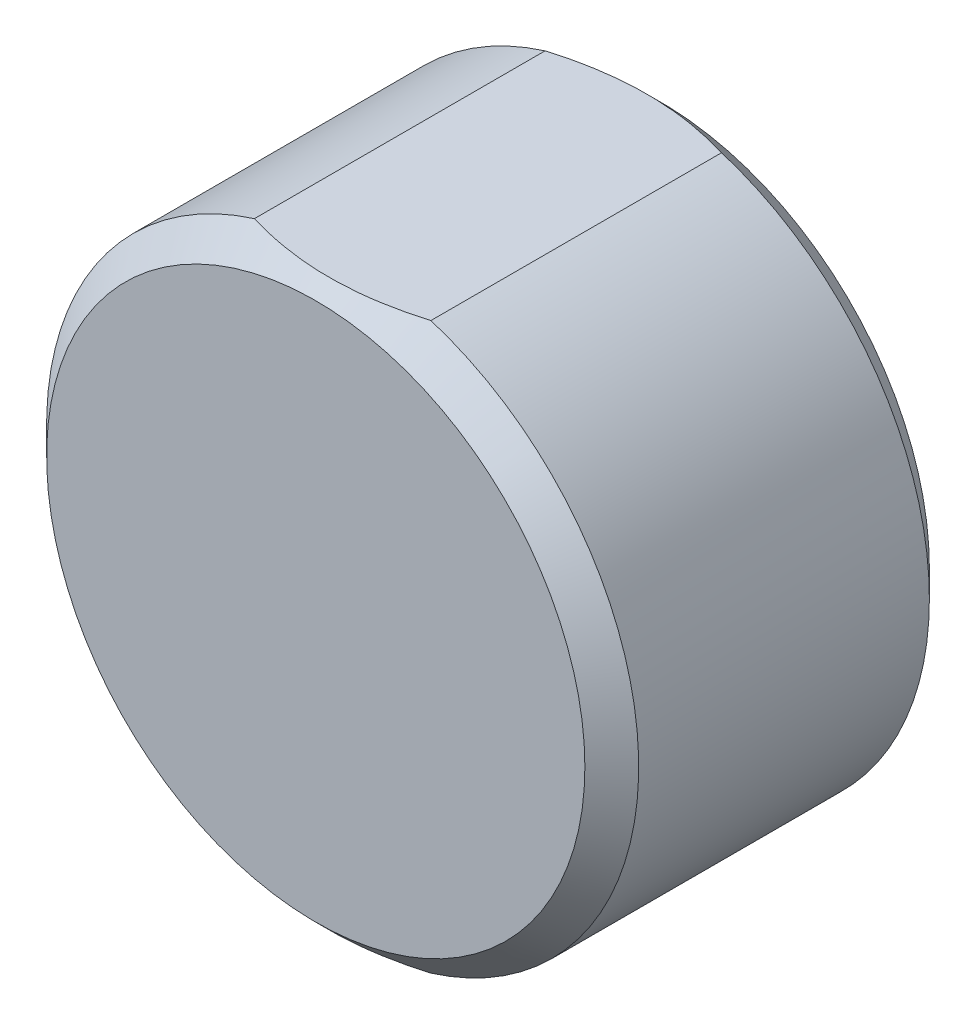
ISO-10303-21;
HEADER;
FILE_DESCRIPTION(('STEP AP214'),'2;1');
FILE_NAME('part.step','',(''),(''),'','','');
FILE_SCHEMA(('AUTOMOTIVE_DESIGN { 1 0 10303 214 1 1 1 1 }'));
ENDSEC;
DATA;
#1=APPLICATION_CONTEXT('core data for automotive mechanical design processes');
#2=APPLICATION_PROTOCOL_DEFINITION('international standard','automotive_design',2000,#1);
#3=PRODUCT_CONTEXT('',#1,'mechanical');
#4=PRODUCT('Part','Part','',(#3));
#5=PRODUCT_RELATED_PRODUCT_CATEGORY('part','',(#4));
#6=PRODUCT_DEFINITION_FORMATION('','',#4);
#7=PRODUCT_DEFINITION_CONTEXT('part definition',#1,'design');
#8=PRODUCT_DEFINITION('design','',#6,#7);
#9=PRODUCT_DEFINITION_SHAPE('','',#8);
#10=(LENGTH_UNIT() NAMED_UNIT(*) SI_UNIT(.MILLI.,.METRE.));
#11=(NAMED_UNIT(*) PLANE_ANGLE_UNIT() SI_UNIT($,.RADIAN.));
#12=(NAMED_UNIT(*) SI_UNIT($,.STERADIAN.) SOLID_ANGLE_UNIT());
#13=UNCERTAINTY_MEASURE_WITH_UNIT(LENGTH_MEASURE(1.E-05),#10,'distance_accuracy_value','');
#14=(GEOMETRIC_REPRESENTATION_CONTEXT(3) GLOBAL_UNCERTAINTY_ASSIGNED_CONTEXT((#13)) GLOBAL_UNIT_ASSIGNED_CONTEXT((#10,
#11,#12)) REPRESENTATION_CONTEXT('',''));
#15=CARTESIAN_POINT('',(0.,0.,0.));
#16=DIRECTION('',(0.,0.,1.));
#17=DIRECTION('',(1.,0.,0.));
#18=AXIS2_PLACEMENT_3D('',#15,#16,#17);
#19=CARTESIAN_POINT('',(0.,0.,12.8));
#20=DIRECTION('',(0.,0.,-1.));
#21=DIRECTION('',(-1.,0.,0.));
#22=AXIS2_PLACEMENT_3D('',#19,#20,#21);
#23=CYLINDRICAL_SURFACE('',#22,11.);
#24=DIRECTION('',(0.,0.,1.));
#25=VECTOR('',#24,1.);
#26=CARTESIAN_POINT('',(-3.278719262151,-10.5,0.));
#27=LINE('',#26,#25);
#28=CARTESIAN_POINT('',(-3.278719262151,-10.5,1.));
#29=VERTEX_POINT('',#28);
#30=CARTESIAN_POINT('',(-3.278719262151,-10.5,11.8));
#31=VERTEX_POINT('',#30);
#32=EDGE_CURVE('E85',#29,#31,#27,.T.);
#33=ORIENTED_EDGE('',*,*,#32,.T.);
#34=CARTESIAN_POINT('',(0.,0.,11.8));
#35=DIRECTION('',(0.,0.,1.));
#36=DIRECTION('',(1.,0.,0.));
#37=AXIS2_PLACEMENT_3D('',#34,#35,#36);
#38=CIRCLE('',#37,11.);
#39=CARTESIAN_POINT('',(-3.278719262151,10.5,11.8));
#40=VERTEX_POINT('',#39);
#41=EDGE_CURVE('E65',#31,#40,#38,.F.);
#42=ORIENTED_EDGE('',*,*,#41,.T.);
#43=DIRECTION('',(0.,0.,1.));
#44=VECTOR('',#43,1.);
#45=CARTESIAN_POINT('',(-3.278719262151,10.5,0.));
#46=LINE('',#45,#44);
#47=CARTESIAN_POINT('',(-3.278719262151,10.5,1.));
#48=VERTEX_POINT('',#47);
#49=EDGE_CURVE('E90',#48,#40,#46,.T.);
#50=ORIENTED_EDGE('',*,*,#49,.F.);
#51=CARTESIAN_POINT('',(0.,0.,1.));
#52=DIRECTION('',(0.,0.,1.));
#53=DIRECTION('',(1.,0.,0.));
#54=AXIS2_PLACEMENT_3D('',#51,#52,#53);
#55=CIRCLE('',#54,11.);
#56=EDGE_CURVE('E104',#48,#29,#55,.T.);
#57=ORIENTED_EDGE('',*,*,#56,.T.);
#58=EDGE_LOOP('',(#33,#42,#50,#57));
#59=FACE_BOUND('',#58,.T.);
#60=ADVANCED_FACE('F38',(#59),#23,.T.);
#61=DIRECTION('',(0.,0.,1.));
#62=VECTOR('',#61,1.);
#63=CARTESIAN_POINT('',(3.278719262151,-10.5,0.));
#64=LINE('',#63,#62);
#65=CARTESIAN_POINT('',(3.278719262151,-10.5,1.));
#66=VERTEX_POINT('',#65);
#67=CARTESIAN_POINT('',(3.278719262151,-10.5,11.8));
#68=VERTEX_POINT('',#67);
#69=EDGE_CURVE('E58',#66,#68,#64,.T.);
#70=ORIENTED_EDGE('',*,*,#69,.F.);
#71=CARTESIAN_POINT('',(3.278719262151,10.5,1.));
#72=VERTEX_POINT('',#71);
#73=EDGE_CURVE('E96',#66,#72,#55,.T.);
#74=ORIENTED_EDGE('',*,*,#73,.T.);
#75=DIRECTION('',(0.,0.,1.));
#76=VECTOR('',#75,1.);
#77=CARTESIAN_POINT('',(3.278719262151,10.5,0.));
#78=LINE('',#77,#76);
#79=CARTESIAN_POINT('',(3.278719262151,10.5,11.8));
#80=VERTEX_POINT('',#79);
#81=EDGE_CURVE('E132',#72,#80,#78,.T.);
#82=ORIENTED_EDGE('',*,*,#81,.T.);
#83=EDGE_CURVE('E99',#80,#68,#38,.F.);
#84=ORIENTED_EDGE('',*,*,#83,.T.);
#85=EDGE_LOOP('',(#70,#74,#82,#84));
#86=FACE_BOUND('',#85,.T.);
#87=ADVANCED_FACE('F94',(#86),#23,.T.);
#88=CARTESIAN_POINT('',(0.,0.,1.));
#89=DIRECTION('',(0.,0.,1.));
#90=DIRECTION('',(1.,0.,0.));
#91=AXIS2_PLACEMENT_3D('',#88,#89,#90);
#92=CONICAL_SURFACE('',#91,11.,0.785398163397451);
#93=CARTESIAN_POINT('',(0.,0.,0.));
#94=DIRECTION('',(0.,0.,1.));
#95=DIRECTION('',(1.,0.,0.));
#96=AXIS2_PLACEMENT_3D('',#93,#94,#95);
#97=CIRCLE('',#96,9.99999999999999);
#98=CARTESIAN_POINT('',(9.99999999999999,0.,0.));
#99=VERTEX_POINT('',#98);
#100=EDGE_CURVE('E106',#99,#99,#97,.F.);
#101=ORIENTED_EDGE('',*,*,#100,.F.);
#102=EDGE_LOOP('',(#101));
#103=FACE_BOUND('',#102,.T.);
#104=ORIENTED_EDGE('',*,*,#73,.F.);
#105=CARTESIAN_POINT('',(-7.10787288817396,-10.5,2.67958425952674));
#106=CARTESIAN_POINT('',(-6.92421202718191,-10.5,2.57664145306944));
#107=CARTESIAN_POINT('',(-6.73938207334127,-10.5,2.47575406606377));
#108=CARTESIAN_POINT('',(-6.36717527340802,-10.5,2.27867675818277));
#109=CARTESIAN_POINT('',(-6.17979777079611,-10.5,2.18248807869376));
#110=CARTESIAN_POINT('',(-5.80165719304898,-10.5,1.99508960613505));
#111=CARTESIAN_POINT('',(-5.6108838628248,-10.5,1.90390040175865));
#112=CARTESIAN_POINT('',(-5.22655261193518,-10.5,1.72764693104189));
#113=CARTESIAN_POINT('',(-5.0329948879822,-10.5,1.64258223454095));
#114=CARTESIAN_POINT('',(-4.44277596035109,-10.5,1.39558317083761));
#115=CARTESIAN_POINT('',(-4.04152891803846,-10.5,1.24434861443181));
#116=CARTESIAN_POINT('',(-3.22760867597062,-10.5,0.978170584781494));
#117=CARTESIAN_POINT('',(-2.81495492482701,-10.5,0.863169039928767));
#118=CARTESIAN_POINT('',(-2.13622111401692,-10.5,0.712072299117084));
#119=CARTESIAN_POINT('',(-1.87311056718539,-10.5,0.662555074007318));
#120=CARTESIAN_POINT('',(-1.34396544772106,-10.5,0.582434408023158));
#121=CARTESIAN_POINT('',(-1.0779307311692,-10.5,0.551831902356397));
#122=CARTESIAN_POINT('',(-0.546362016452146,-10.5,0.510891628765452));
#123=CARTESIAN_POINT('',(-0.280840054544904,-10.5,0.500398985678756));
#124=CARTESIAN_POINT('',(0.250234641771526,-10.5,0.499623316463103));
#125=CARTESIAN_POINT('',(0.515787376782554,-10.5,0.509340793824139));
#126=CARTESIAN_POINT('',(1.08395998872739,-10.5,0.551469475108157));
#127=CARTESIAN_POINT('',(1.38635191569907,-10.5,0.58697659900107));
#128=CARTESIAN_POINT('',(1.98727779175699,-10.5,0.682282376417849));
#129=CARTESIAN_POINT('',(2.28581097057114,-10.5,0.742085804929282));
#130=CARTESIAN_POINT('',(2.88119857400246,-10.5,0.884240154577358));
#131=CARTESIAN_POINT('',(3.17798965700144,-10.5,0.966853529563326));
#132=CARTESIAN_POINT('',(3.76540687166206,-10.5,1.15125568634));
#133=CARTESIAN_POINT('',(4.05603435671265,-10.5,1.2530402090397));
#134=CARTESIAN_POINT('',(4.73983064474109,-10.5,1.51441626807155));
#135=CARTESIAN_POINT('',(5.13019879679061,-10.5,1.68130971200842));
#136=CARTESIAN_POINT('',(5.89983249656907,-10.5,2.03917911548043));
#137=CARTESIAN_POINT('',(6.2790914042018,-10.5,2.23016912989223));
#138=CARTESIAN_POINT('',(7.02893667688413,-10.5,2.63152047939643));
#139=CARTESIAN_POINT('',(7.39948593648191,-10.5,2.84195059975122));
#140=CARTESIAN_POINT('',(8.13175833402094,-10.5,3.27738225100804));
#141=CARTESIAN_POINT('',(8.49348324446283,-10.5,3.50238082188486));
#142=CARTESIAN_POINT('',(9.19181586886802,-10.5,3.95248427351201));
#143=CARTESIAN_POINT('',(9.52878209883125,-10.5,4.17703580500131));
#144=CARTESIAN_POINT('',(10.1969936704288,-10.5,4.63452836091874));
#145=CARTESIAN_POINT('',(10.5282385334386,-10.5,4.8674700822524));
#146=CARTESIAN_POINT('',(11.1829043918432,-10.5,5.33805465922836));
#147=CARTESIAN_POINT('',(11.5063687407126,-10.5,5.57563741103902));
#148=CARTESIAN_POINT('',(12.1490588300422,-10.5,6.05629666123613));
#149=CARTESIAN_POINT('',(12.4682856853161,-10.5,6.2993716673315));
#150=CARTESIAN_POINT('',(12.7857700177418,-10.5,6.54466424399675));
#151=B_SPLINE_CURVE_WITH_KNOTS('',3,(#105,#106,#107,#108,#109,#110,#111,#112,#113,#114,#115,
#116,#117,#118,#119,#120,#121,#122,#123,#124,#125,#126,#127,#128,#129,#130,#131,#132,#133,#134,
#135,#136,#137,#138,#139,#140,#141,#142,#143,#144,#145,#146,#147,#148,#149,#150),.UNSPECIFIED.,
.F.,.F.,(4,2,2,2,2,2,2,2,2,2,2,2,2,2,2,2,2,2,2,2,2,2,4),(0.,0.631638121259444,1.26344222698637,
1.8976781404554,2.53186946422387,3.8168873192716,5.09983504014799,5.90242490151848,
6.70505444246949,7.50147733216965,8.29792006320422,9.21023335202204,10.1227260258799,
11.0461900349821,11.9694491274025,13.2419777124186,14.5152519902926,15.7932179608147,
17.0709250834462,18.2855695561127,19.5003151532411,20.7042752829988,21.9079121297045),.UNSPECIFIED.);
#152=EDGE_CURVE('E83',#66,#29,#151,.F.);
#153=ORIENTED_EDGE('',*,*,#152,.T.);
#154=ORIENTED_EDGE('',*,*,#56,.F.);
#155=CARTESIAN_POINT('',(-7.10787288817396,10.5,2.67958425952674));
#156=CARTESIAN_POINT('',(-6.92421202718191,10.5,2.57664145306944));
#157=CARTESIAN_POINT('',(-6.73938207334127,10.5,2.47575406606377));
#158=CARTESIAN_POINT('',(-6.36717527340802,10.5,2.27867675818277));
#159=CARTESIAN_POINT('',(-6.17979777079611,10.5,2.18248807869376));
#160=CARTESIAN_POINT('',(-5.80165719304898,10.5,1.99508960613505));
#161=CARTESIAN_POINT('',(-5.6108838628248,10.5,1.90390040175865));
#162=CARTESIAN_POINT('',(-5.22655261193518,10.5,1.72764693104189));
#163=CARTESIAN_POINT('',(-5.0329948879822,10.5,1.64258223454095));
#164=CARTESIAN_POINT('',(-4.44277596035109,10.5,1.39558317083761));
#165=CARTESIAN_POINT('',(-4.04152891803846,10.5,1.24434861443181));
#166=CARTESIAN_POINT('',(-3.22760867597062,10.5,0.978170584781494));
#167=CARTESIAN_POINT('',(-2.81495492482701,10.5,0.863169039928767));
#168=CARTESIAN_POINT('',(-2.13622111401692,10.5,0.712072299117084));
#169=CARTESIAN_POINT('',(-1.87311056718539,10.5,0.662555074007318));
#170=CARTESIAN_POINT('',(-1.34396544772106,10.5,0.582434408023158));
#171=CARTESIAN_POINT('',(-1.0779307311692,10.5,0.551831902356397));
#172=CARTESIAN_POINT('',(-0.546362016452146,10.5,0.510891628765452));
#173=CARTESIAN_POINT('',(-0.280840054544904,10.5,0.500398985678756));
#174=CARTESIAN_POINT('',(0.250234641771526,10.5,0.499623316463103));
#175=CARTESIAN_POINT('',(0.515787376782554,10.5,0.509340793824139));
#176=CARTESIAN_POINT('',(1.08395998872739,10.5,0.551469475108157));
#177=CARTESIAN_POINT('',(1.38635191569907,10.5,0.58697659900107));
#178=CARTESIAN_POINT('',(1.98727779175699,10.5,0.682282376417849));
#179=CARTESIAN_POINT('',(2.28581097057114,10.5,0.742085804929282));
#180=CARTESIAN_POINT('',(2.88119857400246,10.5,0.884240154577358));
#181=CARTESIAN_POINT('',(3.17798965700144,10.5,0.966853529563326));
#182=CARTESIAN_POINT('',(3.76540687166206,10.5,1.15125568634));
#183=CARTESIAN_POINT('',(4.05603435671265,10.5,1.2530402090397));
#184=CARTESIAN_POINT('',(4.73983064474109,10.5,1.51441626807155));
#185=CARTESIAN_POINT('',(5.13019879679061,10.5,1.68130971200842));
#186=CARTESIAN_POINT('',(5.89983249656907,10.5,2.03917911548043));
#187=CARTESIAN_POINT('',(6.2790914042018,10.5,2.23016912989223));
#188=CARTESIAN_POINT('',(7.02893667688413,10.5,2.63152047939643));
#189=CARTESIAN_POINT('',(7.39948593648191,10.5,2.84195059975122));
#190=CARTESIAN_POINT('',(8.13175833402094,10.5,3.27738225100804));
#191=CARTESIAN_POINT('',(8.49348324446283,10.5,3.50238082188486));
#192=CARTESIAN_POINT('',(9.19181586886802,10.5,3.95248427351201));
#193=CARTESIAN_POINT('',(9.52878209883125,10.5,4.17703580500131));
#194=CARTESIAN_POINT('',(10.1969936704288,10.5,4.63452836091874));
#195=CARTESIAN_POINT('',(10.5282385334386,10.5,4.8674700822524));
#196=CARTESIAN_POINT('',(11.1829043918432,10.5,5.33805465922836));
#197=CARTESIAN_POINT('',(11.5063687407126,10.5,5.57563741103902));
#198=CARTESIAN_POINT('',(12.1490588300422,10.5,6.05629666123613));
#199=CARTESIAN_POINT('',(12.4682856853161,10.5,6.2993716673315));
#200=CARTESIAN_POINT('',(12.7857700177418,10.5,6.54466424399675));
#201=B_SPLINE_CURVE_WITH_KNOTS('',3,(#155,#156,#157,#158,#159,#160,#161,#162,#163,#164,#165,
#166,#167,#168,#169,#170,#171,#172,#173,#174,#175,#176,#177,#178,#179,#180,#181,#182,#183,#184,
#185,#186,#187,#188,#189,#190,#191,#192,#193,#194,#195,#196,#197,#198,#199,#200),.UNSPECIFIED.,
.F.,.F.,(4,2,2,2,2,2,2,2,2,2,2,2,2,2,2,2,2,2,2,2,2,2,4),(0.,0.631638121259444,1.26344222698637,
1.8976781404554,2.53186946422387,3.8168873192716,5.09983504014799,5.90242490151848,
6.70505444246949,7.50147733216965,8.29792006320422,9.21023335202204,10.1227260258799,
11.0461900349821,11.9694491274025,13.2419777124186,14.5152519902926,15.7932179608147,
17.0709250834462,18.2855695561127,19.5003151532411,20.7042752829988,21.9079121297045),.UNSPECIFIED.);
#202=EDGE_CURVE('E103',#72,#48,#201,.F.);
#203=ORIENTED_EDGE('',*,*,#202,.F.);
#204=EDGE_LOOP('',(#104,#153,#154,#203));
#205=FACE_BOUND('',#204,.T.);
#206=ADVANCED_FACE('F102',(#103,#205),#92,.T.);
#207=CARTESIAN_POINT('',(0.,0.,12.8));
#208=DIRECTION('',(0.,0.,-1.));
#209=DIRECTION('',(-1.,0.,0.));
#210=AXIS2_PLACEMENT_3D('',#207,#208,#209);
#211=CONICAL_SURFACE('',#210,10.,0.785398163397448);
#212=CARTESIAN_POINT('',(0.,0.,12.8));
#213=DIRECTION('',(0.,0.,1.));
#214=DIRECTION('',(1.,0.,0.));
#215=AXIS2_PLACEMENT_3D('',#212,#213,#214);
#216=CIRCLE('',#215,10.);
#217=CARTESIAN_POINT('',(10.,0.,12.8));
#218=VERTEX_POINT('',#217);
#219=EDGE_CURVE('E112',#218,#218,#216,.T.);
#220=ORIENTED_EDGE('',*,*,#219,.F.);
#221=EDGE_LOOP('',(#220));
#222=FACE_BOUND('',#221,.T.);
#223=ORIENTED_EDGE('',*,*,#41,.F.);
#224=CARTESIAN_POINT('',(-7.10787288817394,-10.5,10.1204157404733));
#225=CARTESIAN_POINT('',(-6.9242120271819,-10.5,10.2233585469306));
#226=CARTESIAN_POINT('',(-6.73938207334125,-10.5,10.3242459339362));
#227=CARTESIAN_POINT('',(-6.36717527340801,-10.5,10.5213232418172));
#228=CARTESIAN_POINT('',(-6.1797977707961,-10.5,10.6175119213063));
#229=CARTESIAN_POINT('',(-5.80165719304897,-10.5,10.804910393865));
#230=CARTESIAN_POINT('',(-5.61088386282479,-10.5,10.8960995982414));
#231=CARTESIAN_POINT('',(-5.22655261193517,-10.5,11.0723530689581));
#232=CARTESIAN_POINT('',(-5.03299488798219,-10.5,11.1574177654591));
#233=CARTESIAN_POINT('',(-4.44277596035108,-10.5,11.4044168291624));
#234=CARTESIAN_POINT('',(-4.04152891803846,-10.5,11.5556513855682));
#235=CARTESIAN_POINT('',(-3.22760867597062,-10.5,11.8218294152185));
#236=CARTESIAN_POINT('',(-2.81495492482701,-10.5,11.9368309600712));
#237=CARTESIAN_POINT('',(-2.13622111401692,-10.5,12.0879277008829));
#238=CARTESIAN_POINT('',(-1.8731105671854,-10.5,12.1374449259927));
#239=CARTESIAN_POINT('',(-1.34396544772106,-10.5,12.2175655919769));
#240=CARTESIAN_POINT('',(-1.0779307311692,-10.5,12.2481680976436));
#241=CARTESIAN_POINT('',(-0.546362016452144,-10.5,12.2891083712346));
#242=CARTESIAN_POINT('',(-0.280840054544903,-10.5,12.2996010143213));
#243=CARTESIAN_POINT('',(0.250234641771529,-10.5,12.3003766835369));
#244=CARTESIAN_POINT('',(0.515787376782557,-10.5,12.2906592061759));
#245=CARTESIAN_POINT('',(1.08395998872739,-10.5,12.2485305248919));
#246=CARTESIAN_POINT('',(1.38635191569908,-10.5,12.2130234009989));
#247=CARTESIAN_POINT('',(1.98727779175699,-10.5,12.1177176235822));
#248=CARTESIAN_POINT('',(2.28581097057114,-10.5,12.0579141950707));
#249=CARTESIAN_POINT('',(2.88119857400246,-10.5,11.9157598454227));
#250=CARTESIAN_POINT('',(3.17798965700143,-10.5,11.8331464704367));
#251=CARTESIAN_POINT('',(3.76540687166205,-10.5,11.64874431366));
#252=CARTESIAN_POINT('',(4.05603435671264,-10.5,11.5469597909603));
#253=CARTESIAN_POINT('',(4.73983064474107,-10.5,11.2855837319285));
#254=CARTESIAN_POINT('',(5.13019879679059,-10.5,11.1186902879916));
#255=CARTESIAN_POINT('',(5.89983249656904,-10.5,10.7608208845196));
#256=CARTESIAN_POINT('',(6.27909140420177,-10.5,10.5698308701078));
#257=CARTESIAN_POINT('',(7.02893667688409,-10.5,10.1684795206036));
#258=CARTESIAN_POINT('',(7.39948593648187,-10.5,9.9580494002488));
#259=CARTESIAN_POINT('',(8.13175833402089,-10.5,9.52261774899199));
#260=CARTESIAN_POINT('',(8.49348324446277,-10.5,9.29761917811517));
#261=CARTESIAN_POINT('',(9.19181586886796,-10.5,8.84751572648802));
#262=CARTESIAN_POINT('',(9.52878209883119,-10.5,8.62296419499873));
#263=CARTESIAN_POINT('',(10.1969936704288,-10.5,8.1654716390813));
#264=CARTESIAN_POINT('',(10.5282385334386,-10.5,7.93252991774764));
#265=CARTESIAN_POINT('',(11.1829043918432,-10.5,7.46194534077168));
#266=CARTESIAN_POINT('',(11.5063687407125,-10.5,7.22436258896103));
#267=CARTESIAN_POINT('',(12.1490588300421,-10.5,6.74370333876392));
#268=CARTESIAN_POINT('',(12.468285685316,-10.5,6.50062833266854));
#269=CARTESIAN_POINT('',(12.7857700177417,-10.5,6.25533575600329));
#270=B_SPLINE_CURVE_WITH_KNOTS('',3,(#224,#225,#226,#227,#228,#229,#230,#231,#232,#233,#234,
#235,#236,#237,#238,#239,#240,#241,#242,#243,#244,#245,#246,#247,#248,#249,#250,#251,#252,#253,
#254,#255,#256,#257,#258,#259,#260,#261,#262,#263,#264,#265,#266,#267,#268,#269),.UNSPECIFIED.,
.F.,.F.,(4,2,2,2,2,2,2,2,2,2,2,2,2,2,2,2,2,2,2,2,2,2,4),(0.,0.631638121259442,1.26344222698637,
1.8976781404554,2.53186946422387,3.81688731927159,5.09983504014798,5.90242490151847,
6.70505444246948,7.50147733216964,8.29792006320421,9.21023335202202,10.1227260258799,
11.046190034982,11.9694491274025,13.2419777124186,14.5152519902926,15.7932179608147,
17.0709250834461,18.2855695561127,19.500315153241,20.7042752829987,21.9079121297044),.UNSPECIFIED.);
#271=EDGE_CURVE('E12',#31,#68,#270,.T.);
#272=ORIENTED_EDGE('',*,*,#271,.T.);
#273=ORIENTED_EDGE('',*,*,#83,.F.);
#274=CARTESIAN_POINT('',(-7.10787288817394,10.5,10.1204157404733));
#275=CARTESIAN_POINT('',(-6.9242120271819,10.5,10.2233585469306));
#276=CARTESIAN_POINT('',(-6.73938207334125,10.5,10.3242459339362));
#277=CARTESIAN_POINT('',(-6.36717527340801,10.5,10.5213232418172));
#278=CARTESIAN_POINT('',(-6.1797977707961,10.5,10.6175119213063));
#279=CARTESIAN_POINT('',(-5.80165719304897,10.5,10.804910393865));
#280=CARTESIAN_POINT('',(-5.61088386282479,10.5,10.8960995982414));
#281=CARTESIAN_POINT('',(-5.22655261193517,10.5,11.0723530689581));
#282=CARTESIAN_POINT('',(-5.03299488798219,10.5,11.1574177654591));
#283=CARTESIAN_POINT('',(-4.44277596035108,10.5,11.4044168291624));
#284=CARTESIAN_POINT('',(-4.04152891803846,10.5,11.5556513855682));
#285=CARTESIAN_POINT('',(-3.22760867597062,10.5,11.8218294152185));
#286=CARTESIAN_POINT('',(-2.81495492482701,10.5,11.9368309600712));
#287=CARTESIAN_POINT('',(-2.13622111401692,10.5,12.0879277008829));
#288=CARTESIAN_POINT('',(-1.8731105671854,10.5,12.1374449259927));
#289=CARTESIAN_POINT('',(-1.34396544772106,10.5,12.2175655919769));
#290=CARTESIAN_POINT('',(-1.0779307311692,10.5,12.2481680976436));
#291=CARTESIAN_POINT('',(-0.546362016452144,10.5,12.2891083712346));
#292=CARTESIAN_POINT('',(-0.280840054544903,10.5,12.2996010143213));
#293=CARTESIAN_POINT('',(0.250234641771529,10.5,12.3003766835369));
#294=CARTESIAN_POINT('',(0.515787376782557,10.5,12.2906592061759));
#295=CARTESIAN_POINT('',(1.08395998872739,10.5,12.2485305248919));
#296=CARTESIAN_POINT('',(1.38635191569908,10.5,12.2130234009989));
#297=CARTESIAN_POINT('',(1.98727779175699,10.5,12.1177176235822));
#298=CARTESIAN_POINT('',(2.28581097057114,10.5,12.0579141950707));
#299=CARTESIAN_POINT('',(2.88119857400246,10.5,11.9157598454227));
#300=CARTESIAN_POINT('',(3.17798965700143,10.5,11.8331464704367));
#301=CARTESIAN_POINT('',(3.76540687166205,10.5,11.64874431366));
#302=CARTESIAN_POINT('',(4.05603435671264,10.5,11.5469597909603));
#303=CARTESIAN_POINT('',(4.73983064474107,10.5,11.2855837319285));
#304=CARTESIAN_POINT('',(5.13019879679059,10.5,11.1186902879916));
#305=CARTESIAN_POINT('',(5.89983249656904,10.5,10.7608208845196));
#306=CARTESIAN_POINT('',(6.27909140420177,10.5,10.5698308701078));
#307=CARTESIAN_POINT('',(7.02893667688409,10.5,10.1684795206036));
#308=CARTESIAN_POINT('',(7.39948593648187,10.5,9.9580494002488));
#309=CARTESIAN_POINT('',(8.13175833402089,10.5,9.52261774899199));
#310=CARTESIAN_POINT('',(8.49348324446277,10.5,9.29761917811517));
#311=CARTESIAN_POINT('',(9.19181586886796,10.5,8.84751572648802));
#312=CARTESIAN_POINT('',(9.52878209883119,10.5,8.62296419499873));
#313=CARTESIAN_POINT('',(10.1969936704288,10.5,8.1654716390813));
#314=CARTESIAN_POINT('',(10.5282385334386,10.5,7.93252991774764));
#315=CARTESIAN_POINT('',(11.1829043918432,10.5,7.46194534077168));
#316=CARTESIAN_POINT('',(11.5063687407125,10.5,7.22436258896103));
#317=CARTESIAN_POINT('',(12.1490588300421,10.5,6.74370333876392));
#318=CARTESIAN_POINT('',(12.468285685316,10.5,6.50062833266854));
#319=CARTESIAN_POINT('',(12.7857700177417,10.5,6.25533575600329));
#320=B_SPLINE_CURVE_WITH_KNOTS('',3,(#274,#275,#276,#277,#278,#279,#280,#281,#282,#283,#284,
#285,#286,#287,#288,#289,#290,#291,#292,#293,#294,#295,#296,#297,#298,#299,#300,#301,#302,#303,
#304,#305,#306,#307,#308,#309,#310,#311,#312,#313,#314,#315,#316,#317,#318,#319),.UNSPECIFIED.,
.F.,.F.,(4,2,2,2,2,2,2,2,2,2,2,2,2,2,2,2,2,2,2,2,2,2,4),(0.,0.631638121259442,1.26344222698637,
1.8976781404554,2.53186946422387,3.81688731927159,5.09983504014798,5.90242490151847,
6.70505444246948,7.50147733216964,8.29792006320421,9.21023335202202,10.1227260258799,
11.046190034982,11.9694491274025,13.2419777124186,14.5152519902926,15.7932179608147,
17.0709250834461,18.2855695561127,19.500315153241,20.7042752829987,21.9079121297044),.UNSPECIFIED.);
#321=EDGE_CURVE('E51',#40,#80,#320,.T.);
#322=ORIENTED_EDGE('',*,*,#321,.F.);
#323=EDGE_LOOP('',(#223,#272,#273,#322));
#324=FACE_BOUND('',#323,.T.);
#325=ADVANCED_FACE('F40',(#222,#324),#211,.T.);
#326=CARTESIAN_POINT('',(0.,0.,12.8));
#327=DIRECTION('',(0.,0.,1.));
#328=DIRECTION('',(1.,0.,0.));
#329=AXIS2_PLACEMENT_3D('',#326,#327,#328);
#330=PLANE('',#329);
#331=ORIENTED_EDGE('',*,*,#219,.T.);
#332=EDGE_LOOP('',(#331));
#333=FACE_BOUND('',#332,.T.);
#334=ADVANCED_FACE('F125',(#333),#330,.T.);
#335=CARTESIAN_POINT('',(0.,0.,0.));
#336=DIRECTION('',(0.,0.,1.));
#337=DIRECTION('',(1.,0.,0.));
#338=AXIS2_PLACEMENT_3D('',#335,#336,#337);
#339=PLANE('',#338);
#340=ORIENTED_EDGE('',*,*,#100,.T.);
#341=EDGE_LOOP('',(#340));
#342=FACE_BOUND('',#341,.T.);
#343=ADVANCED_FACE('F122',(#342),#339,.F.);
#344=CARTESIAN_POINT('',(-3.278719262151,10.5,0.));
#345=DIRECTION('',(0.,-1.,0.));
#346=DIRECTION('',(0.,0.,-1.));
#347=AXIS2_PLACEMENT_3D('',#344,#345,#346);
#348=PLANE('',#347);
#349=ORIENTED_EDGE('',*,*,#202,.T.);
#350=ORIENTED_EDGE('',*,*,#49,.T.);
#351=ORIENTED_EDGE('',*,*,#321,.T.);
#352=ORIENTED_EDGE('',*,*,#81,.F.);
#353=EDGE_LOOP('',(#349,#350,#351,#352));
#354=FACE_BOUND('',#353,.T.);
#355=ADVANCED_FACE('F118',(#354),#348,.F.);
#356=CARTESIAN_POINT('',(-3.278719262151,-10.5,0.));
#357=DIRECTION('',(0.,-1.,0.));
#358=DIRECTION('',(0.,0.,-1.));
#359=AXIS2_PLACEMENT_3D('',#356,#357,#358);
#360=PLANE('',#359);
#361=ORIENTED_EDGE('',*,*,#69,.T.);
#362=ORIENTED_EDGE('',*,*,#271,.F.);
#363=ORIENTED_EDGE('',*,*,#32,.F.);
#364=ORIENTED_EDGE('',*,*,#152,.F.);
#365=EDGE_LOOP('',(#361,#362,#363,#364));
#366=FACE_BOUND('',#365,.T.);
#367=ADVANCED_FACE('F84',(#366),#360,.T.);
#368=CLOSED_SHELL('',(#60,#87,#206,#325,#334,#343,#355,#367));
#369=MANIFOLD_SOLID_BREP('B2',#368);
#370=ADVANCED_BREP_SHAPE_REPRESENTATION('',(#18,#369),#14);
#371=SHAPE_DEFINITION_REPRESENTATION(#9,#370);
ENDSEC;
END-ISO-10303-21;
